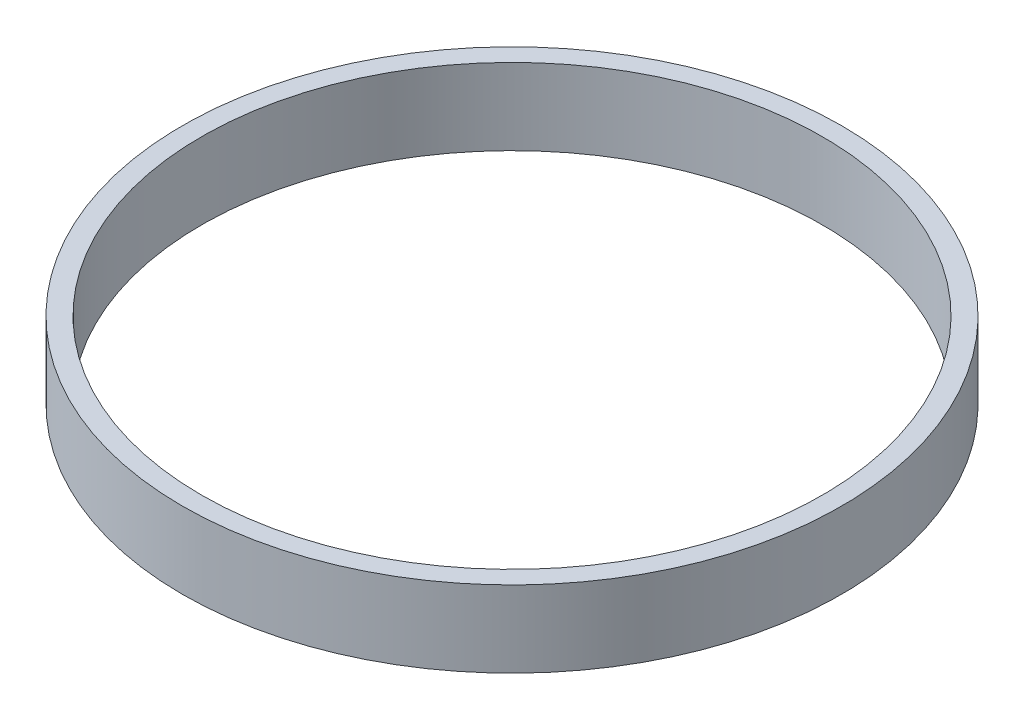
ISO-10303-21;
HEADER;
FILE_DESCRIPTION(('STEP AP214'),'2;1');
FILE_NAME('part.step','',(''),(''),'','','');
FILE_SCHEMA(('AUTOMOTIVE_DESIGN { 1 0 10303 214 1 1 1 1 }'));
ENDSEC;
DATA;
#1=APPLICATION_CONTEXT('core data for automotive mechanical design processes');
#2=APPLICATION_PROTOCOL_DEFINITION('international standard','automotive_design',2000,#1);
#3=PRODUCT_CONTEXT('',#1,'mechanical');
#4=PRODUCT('Part','Part','',(#3));
#5=PRODUCT_RELATED_PRODUCT_CATEGORY('part','',(#4));
#6=PRODUCT_DEFINITION_FORMATION('','',#4);
#7=PRODUCT_DEFINITION_CONTEXT('part definition',#1,'design');
#8=PRODUCT_DEFINITION('design','',#6,#7);
#9=PRODUCT_DEFINITION_SHAPE('','',#8);
#10=(LENGTH_UNIT() NAMED_UNIT(*) SI_UNIT(.MILLI.,.METRE.));
#11=(NAMED_UNIT(*) PLANE_ANGLE_UNIT() SI_UNIT($,.RADIAN.));
#12=(NAMED_UNIT(*) SI_UNIT($,.STERADIAN.) SOLID_ANGLE_UNIT());
#13=UNCERTAINTY_MEASURE_WITH_UNIT(LENGTH_MEASURE(1.E-05),#10,'distance_accuracy_value','');
#14=(GEOMETRIC_REPRESENTATION_CONTEXT(3) GLOBAL_UNCERTAINTY_ASSIGNED_CONTEXT((#13)) GLOBAL_UNIT_ASSIGNED_CONTEXT((#10,
#11,#12)) REPRESENTATION_CONTEXT('',''));
#15=CARTESIAN_POINT('',(0.,0.,0.));
#16=DIRECTION('',(0.,0.,1.));
#17=DIRECTION('',(1.,0.,0.));
#18=AXIS2_PLACEMENT_3D('',#15,#16,#17);
#19=CARTESIAN_POINT('',(0.,25.4,0.));
#20=DIRECTION('',(0.,1.,0.));
#21=DIRECTION('',(0.,0.,1.));
#22=AXIS2_PLACEMENT_3D('',#19,#20,#21);
#23=PLANE('',#22);
#24=CARTESIAN_POINT('',(0.,25.4,0.));
#25=DIRECTION('',(0.,1.,0.));
#26=DIRECTION('',(0.,0.,1.));
#27=AXIS2_PLACEMENT_3D('',#24,#25,#26);
#28=CIRCLE('',#27,109.5375);
#29=CARTESIAN_POINT('',(0.,25.4,109.5375));
#30=VERTEX_POINT('',#29);
#31=EDGE_CURVE('E10',#30,#30,#28,.T.);
#32=ORIENTED_EDGE('',*,*,#31,.T.);
#33=EDGE_LOOP('',(#32));
#34=FACE_BOUND('',#33,.T.);
#35=CARTESIAN_POINT('',(0.,25.4,0.));
#36=DIRECTION('',(0.,1.,0.));
#37=DIRECTION('',(0.,0.,1.));
#38=AXIS2_PLACEMENT_3D('',#35,#36,#37);
#39=CIRCLE('',#38,103.1875);
#40=CARTESIAN_POINT('',(0.,25.4,103.1875));
#41=VERTEX_POINT('',#40);
#42=EDGE_CURVE('E42',#41,#41,#39,.T.);
#43=ORIENTED_EDGE('',*,*,#42,.F.);
#44=EDGE_LOOP('',(#43));
#45=FACE_BOUND('',#44,.T.);
#46=ADVANCED_FACE('F31',(#34,#45),#23,.T.);
#47=CARTESIAN_POINT('',(0.,0.,0.));
#48=DIRECTION('',(0.,1.,0.));
#49=DIRECTION('',(0.,0.,1.));
#50=AXIS2_PLACEMENT_3D('',#47,#48,#49);
#51=PLANE('',#50);
#52=CARTESIAN_POINT('',(0.,0.,0.));
#53=DIRECTION('',(0.,1.,0.));
#54=DIRECTION('',(0.,0.,1.));
#55=AXIS2_PLACEMENT_3D('',#52,#53,#54);
#56=CIRCLE('',#55,109.5375);
#57=CARTESIAN_POINT('',(0.,0.,109.5375));
#58=VERTEX_POINT('',#57);
#59=EDGE_CURVE('E35',#58,#58,#56,.T.);
#60=ORIENTED_EDGE('',*,*,#59,.F.);
#61=EDGE_LOOP('',(#60));
#62=FACE_BOUND('',#61,.T.);
#63=CARTESIAN_POINT('',(0.,0.,0.));
#64=DIRECTION('',(0.,1.,0.));
#65=DIRECTION('',(0.,0.,1.));
#66=AXIS2_PLACEMENT_3D('',#63,#64,#65);
#67=CIRCLE('',#66,103.1875);
#68=CARTESIAN_POINT('',(0.,0.,103.1875));
#69=VERTEX_POINT('',#68);
#70=EDGE_CURVE('E44',#69,#69,#67,.T.);
#71=ORIENTED_EDGE('',*,*,#70,.T.);
#72=EDGE_LOOP('',(#71));
#73=FACE_BOUND('',#72,.T.);
#74=ADVANCED_FACE('F54',(#62,#73),#51,.F.);
#75=CARTESIAN_POINT('',(0.,25.4,0.));
#76=DIRECTION('',(0.,-1.,0.));
#77=DIRECTION('',(0.,0.,-1.));
#78=AXIS2_PLACEMENT_3D('',#75,#76,#77);
#79=CYLINDRICAL_SURFACE('',#78,109.5375);
#80=ORIENTED_EDGE('',*,*,#31,.F.);
#81=EDGE_LOOP('',(#80));
#82=FACE_BOUND('',#81,.T.);
#83=ORIENTED_EDGE('',*,*,#59,.T.);
#84=EDGE_LOOP('',(#83));
#85=FACE_BOUND('',#84,.T.);
#86=ADVANCED_FACE('F33',(#82,#85),#79,.T.);
#87=CARTESIAN_POINT('',(0.,25.4,0.));
#88=DIRECTION('',(0.,-1.,0.));
#89=DIRECTION('',(0.,0.,-1.));
#90=AXIS2_PLACEMENT_3D('',#87,#88,#89);
#91=CYLINDRICAL_SURFACE('',#90,103.1875);
#92=ORIENTED_EDGE('',*,*,#42,.T.);
#93=EDGE_LOOP('',(#92));
#94=FACE_BOUND('',#93,.T.);
#95=ORIENTED_EDGE('',*,*,#70,.F.);
#96=EDGE_LOOP('',(#95));
#97=FACE_BOUND('',#96,.T.);
#98=ADVANCED_FACE('F50',(#94,#97),#91,.F.);
#99=CLOSED_SHELL('',(#46,#74,#86,#98));
#100=MANIFOLD_SOLID_BREP('B2',#99);
#101=ADVANCED_BREP_SHAPE_REPRESENTATION('',(#18,#100),#14);
#102=SHAPE_DEFINITION_REPRESENTATION(#9,#101);
ENDSEC;
END-ISO-10303-21;
